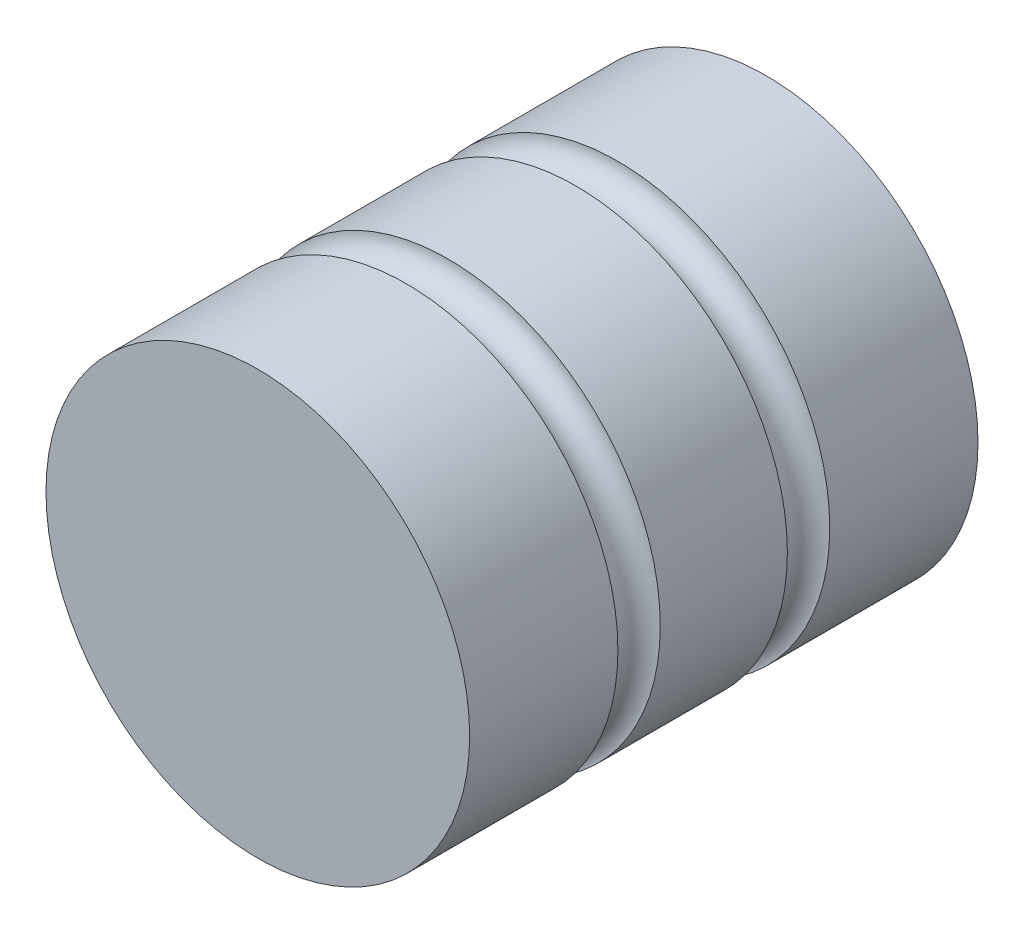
ISO-10303-21;
HEADER;
FILE_DESCRIPTION(('STEP AP214'),'2;1');
FILE_NAME('part.step','',(''),(''),'','','');
FILE_SCHEMA(('AUTOMOTIVE_DESIGN { 1 0 10303 214 1 1 1 1 }'));
ENDSEC;
DATA;
#1=APPLICATION_CONTEXT('core data for automotive mechanical design processes');
#2=APPLICATION_PROTOCOL_DEFINITION('international standard','automotive_design',2000,#1);
#3=PRODUCT_CONTEXT('',#1,'mechanical');
#4=PRODUCT('Part','Part','',(#3));
#5=PRODUCT_RELATED_PRODUCT_CATEGORY('part','',(#4));
#6=PRODUCT_DEFINITION_FORMATION('','',#4);
#7=PRODUCT_DEFINITION_CONTEXT('part definition',#1,'design');
#8=PRODUCT_DEFINITION('design','',#6,#7);
#9=PRODUCT_DEFINITION_SHAPE('','',#8);
#10=(LENGTH_UNIT() NAMED_UNIT(*) SI_UNIT(.MILLI.,.METRE.));
#11=(NAMED_UNIT(*) PLANE_ANGLE_UNIT() SI_UNIT($,.RADIAN.));
#12=(NAMED_UNIT(*) SI_UNIT($,.STERADIAN.) SOLID_ANGLE_UNIT());
#13=UNCERTAINTY_MEASURE_WITH_UNIT(LENGTH_MEASURE(1.E-05),#10,'distance_accuracy_value','');
#14=(GEOMETRIC_REPRESENTATION_CONTEXT(3) GLOBAL_UNCERTAINTY_ASSIGNED_CONTEXT((#13)) GLOBAL_UNIT_ASSIGNED_CONTEXT((#10,
#11,#12)) REPRESENTATION_CONTEXT('',''));
#15=CARTESIAN_POINT('',(0.,0.,0.));
#16=DIRECTION('',(0.,0.,1.));
#17=DIRECTION('',(1.,0.,0.));
#18=AXIS2_PLACEMENT_3D('',#15,#16,#17);
#19=CARTESIAN_POINT('',(0.,0.,120.));
#20=DIRECTION('',(0.,0.,-1.));
#21=DIRECTION('',(-1.,0.,0.));
#22=AXIS2_PLACEMENT_3D('',#19,#20,#21);
#23=CYLINDRICAL_SURFACE('',#22,50.);
#24=CARTESIAN_POINT('',(0.,0.,75.));
#25=DIRECTION('',(0.,0.,1.));
#26=DIRECTION('',(1.,0.,0.));
#27=AXIS2_PLACEMENT_3D('',#24,#25,#26);
#28=CIRCLE('',#27,50.);
#29=CARTESIAN_POINT('',(50.,0.,75.));
#30=VERTEX_POINT('',#29);
#31=EDGE_CURVE('E44',#30,#30,#28,.T.);
#32=ORIENTED_EDGE('',*,*,#31,.F.);
#33=EDGE_LOOP('',(#32));
#34=FACE_BOUND('',#33,.T.);
#35=CARTESIAN_POINT('',(0.,0.,45.));
#36=DIRECTION('',(0.,0.,1.));
#37=DIRECTION('',(1.,0.,0.));
#38=AXIS2_PLACEMENT_3D('',#35,#36,#37);
#39=CIRCLE('',#38,50.);
#40=CARTESIAN_POINT('',(50.,0.,45.));
#41=VERTEX_POINT('',#40);
#42=EDGE_CURVE('E54',#41,#41,#39,.T.);
#43=ORIENTED_EDGE('',*,*,#42,.T.);
#44=EDGE_LOOP('',(#43));
#45=FACE_BOUND('',#44,.T.);
#46=ADVANCED_FACE('F33',(#34,#45),#23,.T.);
#47=CARTESIAN_POINT('',(0.,0.,120.));
#48=DIRECTION('',(0.,0.,1.));
#49=DIRECTION('',(1.,0.,0.));
#50=AXIS2_PLACEMENT_3D('',#47,#48,#49);
#51=CIRCLE('',#50,50.);
#52=CARTESIAN_POINT('',(50.,0.,120.));
#53=VERTEX_POINT('',#52);
#54=EDGE_CURVE('E10',#53,#53,#51,.T.);
#55=ORIENTED_EDGE('',*,*,#54,.F.);
#56=EDGE_LOOP('',(#55));
#57=FACE_BOUND('',#56,.T.);
#58=CARTESIAN_POINT('',(0.,0.,85.));
#59=DIRECTION('',(0.,0.,1.));
#60=DIRECTION('',(1.,0.,0.));
#61=AXIS2_PLACEMENT_3D('',#58,#59,#60);
#62=CIRCLE('',#61,50.);
#63=CARTESIAN_POINT('',(50.,0.,85.));
#64=VERTEX_POINT('',#63);
#65=EDGE_CURVE('E48',#64,#64,#62,.T.);
#66=ORIENTED_EDGE('',*,*,#65,.T.);
#67=EDGE_LOOP('',(#66));
#68=FACE_BOUND('',#67,.T.);
#69=ADVANCED_FACE('F35',(#57,#68),#23,.T.);
#70=CARTESIAN_POINT('',(0.,0.,120.));
#71=DIRECTION('',(0.,0.,1.));
#72=DIRECTION('',(1.,0.,0.));
#73=AXIS2_PLACEMENT_3D('',#70,#71,#72);
#74=PLANE('',#73);
#75=ORIENTED_EDGE('',*,*,#54,.T.);
#76=EDGE_LOOP('',(#75));
#77=FACE_BOUND('',#76,.T.);
#78=ADVANCED_FACE('F71',(#77),#74,.T.);
#79=CARTESIAN_POINT('',(0.,0.,80.));
#80=DIRECTION('',(0.,0.,1.));
#81=DIRECTION('',(1.,0.,0.));
#82=AXIS2_PLACEMENT_3D('',#79,#80,#81);
#83=TOROIDAL_SURFACE('',#82,50.,5.);
#84=ORIENTED_EDGE('',*,*,#31,.T.);
#85=EDGE_LOOP('',(#84));
#86=FACE_BOUND('',#85,.T.);
#87=ORIENTED_EDGE('',*,*,#65,.F.);
#88=EDGE_LOOP('',(#87));
#89=FACE_BOUND('',#88,.T.);
#90=ADVANCED_FACE('F62',(#86,#89),#83,.F.);
#91=CARTESIAN_POINT('',(0.,0.,40.));
#92=DIRECTION('',(0.,0.,1.));
#93=DIRECTION('',(1.,0.,0.));
#94=AXIS2_PLACEMENT_3D('',#91,#92,#93);
#95=TOROIDAL_SURFACE('',#94,50.,4.99999999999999);
#96=CARTESIAN_POINT('',(0.,0.,35.));
#97=DIRECTION('',(0.,0.,1.));
#98=DIRECTION('',(1.,0.,0.));
#99=AXIS2_PLACEMENT_3D('',#96,#97,#98);
#100=CIRCLE('',#99,50.);
#101=CARTESIAN_POINT('',(50.,0.,35.));
#102=VERTEX_POINT('',#101);
#103=EDGE_CURVE('E51',#102,#102,#100,.T.);
#104=ORIENTED_EDGE('',*,*,#103,.T.);
#105=EDGE_LOOP('',(#104));
#106=FACE_BOUND('',#105,.T.);
#107=ORIENTED_EDGE('',*,*,#42,.F.);
#108=EDGE_LOOP('',(#107));
#109=FACE_BOUND('',#108,.T.);
#110=ADVANCED_FACE('F59',(#106,#109),#95,.F.);
#111=CARTESIAN_POINT('',(0.,0.,0.));
#112=DIRECTION('',(0.,0.,1.));
#113=DIRECTION('',(1.,0.,0.));
#114=AXIS2_PLACEMENT_3D('',#111,#112,#113);
#115=PLANE('',#114);
#116=CARTESIAN_POINT('',(0.,0.,0.));
#117=DIRECTION('',(0.,0.,1.));
#118=DIRECTION('',(1.,0.,0.));
#119=AXIS2_PLACEMENT_3D('',#116,#117,#118);
#120=CIRCLE('',#119,50.);
#121=CARTESIAN_POINT('',(50.,0.,0.));
#122=VERTEX_POINT('',#121);
#123=EDGE_CURVE('E37',#122,#122,#120,.T.);
#124=ORIENTED_EDGE('',*,*,#123,.F.);
#125=EDGE_LOOP('',(#124));
#126=FACE_BOUND('',#125,.T.);
#127=ADVANCED_FACE('F61',(#126),#115,.F.);
#128=ORIENTED_EDGE('',*,*,#123,.T.);
#129=EDGE_LOOP('',(#128));
#130=FACE_BOUND('',#129,.T.);
#131=ORIENTED_EDGE('',*,*,#103,.F.);
#132=EDGE_LOOP('',(#131));
#133=FACE_BOUND('',#132,.T.);
#134=ADVANCED_FACE('F69',(#130,#133),#23,.T.);
#135=CLOSED_SHELL('',(#46,#69,#78,#90,#110,#127,#134));
#136=MANIFOLD_SOLID_BREP('B2',#135);
#137=ADVANCED_BREP_SHAPE_REPRESENTATION('',(#18,#136),#14);
#138=SHAPE_DEFINITION_REPRESENTATION(#9,#137);
ENDSEC;
END-ISO-10303-21;
